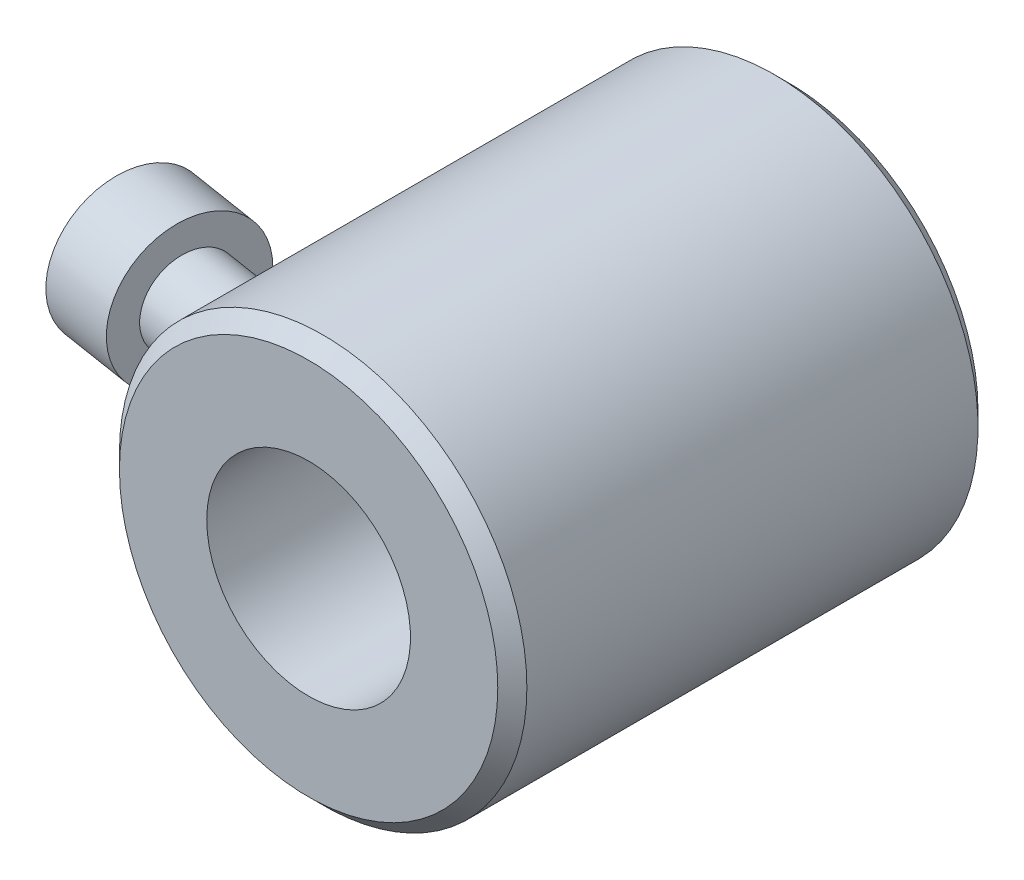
ISO-10303-21;
HEADER;
FILE_DESCRIPTION(('STEP AP214'),'2;1');
FILE_NAME('part.step','',(''),(''),'','','');
FILE_SCHEMA(('AUTOMOTIVE_DESIGN { 1 0 10303 214 1 1 1 1 }'));
ENDSEC;
DATA;
#1=APPLICATION_CONTEXT('core data for automotive mechanical design processes');
#2=APPLICATION_PROTOCOL_DEFINITION('international standard','automotive_design',2000,#1);
#3=PRODUCT_CONTEXT('',#1,'mechanical');
#4=PRODUCT('Part','Part','',(#3));
#5=PRODUCT_RELATED_PRODUCT_CATEGORY('part','',(#4));
#6=PRODUCT_DEFINITION_FORMATION('','',#4);
#7=PRODUCT_DEFINITION_CONTEXT('part definition',#1,'design');
#8=PRODUCT_DEFINITION('design','',#6,#7);
#9=PRODUCT_DEFINITION_SHAPE('','',#8);
#10=(LENGTH_UNIT() NAMED_UNIT(*) SI_UNIT(.MILLI.,.METRE.));
#11=(NAMED_UNIT(*) PLANE_ANGLE_UNIT() SI_UNIT($,.RADIAN.));
#12=(NAMED_UNIT(*) SI_UNIT($,.STERADIAN.) SOLID_ANGLE_UNIT());
#13=UNCERTAINTY_MEASURE_WITH_UNIT(LENGTH_MEASURE(1.E-05),#10,'distance_accuracy_value','');
#14=(GEOMETRIC_REPRESENTATION_CONTEXT(3) GLOBAL_UNCERTAINTY_ASSIGNED_CONTEXT((#13)) GLOBAL_UNIT_ASSIGNED_CONTEXT((#10,
#11,#12)) REPRESENTATION_CONTEXT('',''));
#15=CARTESIAN_POINT('',(0.,0.,0.));
#16=DIRECTION('',(0.,0.,1.));
#17=DIRECTION('',(1.,0.,0.));
#18=AXIS2_PLACEMENT_3D('',#15,#16,#17);
#19=CARTESIAN_POINT('',(0.,0.,110.));
#20=DIRECTION('',(0.,0.,1.));
#21=DIRECTION('',(-1.,0.,0.));
#22=AXIS2_PLACEMENT_3D('',#19,#20,#21);
#23=CYLINDRICAL_SURFACE('',#22,14.);
#24=CARTESIAN_POINT('',(-14.,0.,18.6127242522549));
#25=CARTESIAN_POINT('',(-13.999996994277,-0.161729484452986,18.6127311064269));
#26=CARTESIAN_POINT('',(-13.9971679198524,-0.323531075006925,18.626468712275));
#27=CARTESIAN_POINT('',(-13.9861651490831,-0.642424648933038,18.6808615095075));
#28=CARTESIAN_POINT('',(-13.9779872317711,-0.799512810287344,18.7215379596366));
#29=CARTESIAN_POINT('',(-13.9572213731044,-1.10419941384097,18.8280562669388));
#30=CARTESIAN_POINT('',(-13.9446426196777,-1.25181687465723,18.8938457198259));
#31=CARTESIAN_POINT('',(-13.9164044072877,-1.53423024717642,19.0482242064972));
#32=CARTESIAN_POINT('',(-13.9007447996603,-1.66902553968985,19.1368143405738));
#33=CARTESIAN_POINT('',(-13.8673501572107,-1.92721186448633,19.3374645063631));
#34=CARTESIAN_POINT('',(-13.8495620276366,-2.05004626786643,19.4502311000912));
#35=CARTESIAN_POINT('',(-13.8142115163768,-2.27611060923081,19.6939909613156));
#36=CARTESIAN_POINT('',(-13.7966491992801,-2.3793350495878,19.8249893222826));
#37=CARTESIAN_POINT('',(-13.7626951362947,-2.56865097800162,20.1089946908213));
#38=CARTESIAN_POINT('',(-13.7464104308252,-2.65358469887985,20.2627882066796));
#39=CARTESIAN_POINT('',(-13.7179645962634,-2.79692944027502,20.5826534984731));
#40=CARTESIAN_POINT('',(-13.7058037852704,-2.85533841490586,20.7487262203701));
#41=CARTESIAN_POINT('',(-13.6870431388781,-2.94396652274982,21.0896434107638));
#42=CARTESIAN_POINT('',(-13.6804772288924,-2.974013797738,21.2645346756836));
#43=CARTESIAN_POINT('',(-13.6739510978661,-3.00388307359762,21.6170016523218));
#44=CARTESIAN_POINT('',(-13.6739892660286,-3.00371244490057,21.7945766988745));
#45=CARTESIAN_POINT('',(-13.6806644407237,-2.97315312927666,22.1408530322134));
#46=CARTESIAN_POINT('',(-13.6870755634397,-2.94379882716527,22.3096500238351));
#47=CARTESIAN_POINT('',(-13.7054760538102,-2.8569007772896,22.6395013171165));
#48=CARTESIAN_POINT('',(-13.7174646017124,-2.7993611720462,22.8005567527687));
#49=CARTESIAN_POINT('',(-13.7452446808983,-2.65954024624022,23.1058833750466));
#50=CARTESIAN_POINT('',(-13.7609250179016,-2.577967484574,23.2504899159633));
#51=CARTESIAN_POINT('',(-13.7944928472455,-2.39183596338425,23.5237722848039));
#52=CARTESIAN_POINT('',(-13.8123803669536,-2.28727691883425,23.652447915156));
#53=CARTESIAN_POINT('',(-13.8484147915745,-2.05788258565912,23.8906741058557));
#54=CARTESIAN_POINT('',(-13.8665621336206,-1.93300822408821,24.0001869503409));
#55=CARTESIAN_POINT('',(-13.9010950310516,-1.66660503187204,24.1969780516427));
#56=CARTESIAN_POINT('',(-13.9174804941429,-1.52507532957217,24.2842551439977));
#57=CARTESIAN_POINT('',(-13.9468775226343,-1.22766045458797,24.435193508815));
#58=CARTESIAN_POINT('',(-13.959850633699,-1.07163643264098,24.4985888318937));
#59=CARTESIAN_POINT('',(-13.9807679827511,-0.750952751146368,24.5987943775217));
#60=CARTESIAN_POINT('',(-13.9887121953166,-0.586293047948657,24.6356044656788));
#61=CARTESIAN_POINT('',(-13.9987169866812,-0.252639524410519,24.6817417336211));
#62=CARTESIAN_POINT('',(-14.0007652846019,-0.0836373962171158,24.6910115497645));
#63=CARTESIAN_POINT('',(-13.998719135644,0.253555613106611,24.6816636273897));
#64=CARTESIAN_POINT('',(-13.9946246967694,0.421746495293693,24.6630459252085));
#65=CARTESIAN_POINT('',(-13.9807506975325,0.752294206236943,24.5984531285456));
#66=CARTESIAN_POINT('',(-13.9709792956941,0.914659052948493,24.5525172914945));
#67=CARTESIAN_POINT('',(-13.9468240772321,1.22922873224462,24.4344984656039));
#68=CARTESIAN_POINT('',(-13.9324401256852,1.38143326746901,24.3624147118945));
#69=CARTESIAN_POINT('',(-13.900611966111,1.67163263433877,24.1938021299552));
#70=CARTESIAN_POINT('',(-13.8831627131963,1.80960343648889,24.0972328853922));
#71=CARTESIAN_POINT('',(-13.8471633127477,2.06712437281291,23.8822098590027));
#72=CARTESIAN_POINT('',(-13.8286131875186,2.18667488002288,23.7637565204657));
#73=CARTESIAN_POINT('',(-13.7925661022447,2.40358159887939,23.5085227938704));
#74=CARTESIAN_POINT('',(-13.7750660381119,2.5010058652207,23.3718007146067));
#75=CARTESIAN_POINT('',(-13.7430540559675,2.67133079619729,23.0835428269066));
#76=CARTESIAN_POINT('',(-13.7285418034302,2.74423420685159,22.932008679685));
#77=CARTESIAN_POINT('',(-13.7042977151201,2.86284309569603,22.6202568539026));
#78=CARTESIAN_POINT('',(-13.6945139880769,2.90884502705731,22.4601559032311));
#79=CARTESIAN_POINT('',(-13.6805426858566,2.97386456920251,22.134343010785));
#80=CARTESIAN_POINT('',(-13.6763550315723,2.99288256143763,21.9686311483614));
#81=CARTESIAN_POINT('',(-13.6739589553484,3.00381026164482,21.636177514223));
#82=CARTESIAN_POINT('',(-13.6757548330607,2.99570047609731,21.469435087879));
#83=CARTESIAN_POINT('',(-13.6850326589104,2.95302273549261,21.1395419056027));
#84=CARTESIAN_POINT('',(-13.6925155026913,2.91845061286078,20.9763917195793));
#85=CARTESIAN_POINT('',(-13.7125637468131,2.8227716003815,20.6532480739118));
#86=CARTESIAN_POINT('',(-13.7252697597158,2.76092685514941,20.4934820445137));
#87=CARTESIAN_POINT('',(-13.7543041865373,2.61243482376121,20.1862659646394));
#88=CARTESIAN_POINT('',(-13.7706334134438,2.52578196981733,20.0388186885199));
#89=CARTESIAN_POINT('',(-13.8057121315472,2.32655519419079,19.7553860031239));
#90=CARTESIAN_POINT('',(-13.8245242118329,2.21321265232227,19.6199474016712));
#91=CARTESIAN_POINT('',(-13.8619670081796,1.96508890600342,19.3702531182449));
#92=CARTESIAN_POINT('',(-13.880597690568,1.83030379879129,19.2560013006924));
#93=CARTESIAN_POINT('',(-13.9153691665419,1.54374834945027,19.0532802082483));
#94=CARTESIAN_POINT('',(-13.9315272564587,1.39211014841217,18.9646275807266));
#95=CARTESIAN_POINT('',(-13.9595447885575,1.07529751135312,18.8155129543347));
#96=CARTESIAN_POINT('',(-13.9714097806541,0.910140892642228,18.7550145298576));
#97=CARTESIAN_POINT('',(-13.9867785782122,0.620226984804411,18.6777629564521));
#98=CARTESIAN_POINT('',(-13.9917057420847,0.497514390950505,18.6534322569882));
#99=CARTESIAN_POINT('',(-13.9983174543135,0.249882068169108,18.6209110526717));
#100=CARTESIAN_POINT('',(-14.0000023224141,0.124962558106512,18.6127189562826));
#101=CARTESIAN_POINT('',(-14.,0.,18.6127242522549));
#102=B_SPLINE_CURVE_WITH_KNOTS('',3,(#24,#25,#26,#27,#28,#29,#30,#31,#32,#33,#34,#35,#36,#37,
#38,#39,#40,#41,#42,#43,#44,#45,#46,#47,#48,#49,#50,#51,#52,#53,#54,#55,#56,#57,#58,#59,#60,#61,
#62,#63,#64,#65,#66,#67,#68,#69,#70,#71,#72,#73,#74,#75,#76,#77,#78,#79,#80,#81,#82,#83,#84,#85,
#86,#87,#88,#89,#90,#91,#92,#93,#94,#95,#96,#97,#98,#99,#100,#101),.UNSPECIFIED.,.T.,.F.,(4,2,2,
2,2,2,2,2,2,2,2,2,2,2,2,2,2,2,2,2,2,2,2,2,2,2,2,2,2,2,2,2,2,2,2,2,2,2,4),(0.,0.484717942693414,
0.96981885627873,1.45391297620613,1.93803046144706,2.43891405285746,2.93993785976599,
3.46679403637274,3.99369084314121,4.52376027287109,5.05370041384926,5.56550384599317,
6.07723207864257,6.57516963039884,7.07311335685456,7.57202636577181,8.07096549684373,
8.57530722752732,9.07965150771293,9.58504555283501,10.0904389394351,10.5951078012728,
11.0997914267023,11.6053135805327,12.1108254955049,12.6147608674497,13.1186397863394,
13.6168559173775,14.115065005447,14.6136321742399,15.112277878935,15.6253319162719,
16.1385011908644,16.6687981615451,17.1991917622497,17.7256864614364,18.2514980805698,
18.6260591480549,19.000583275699),.UNSPECIFIED.);
#103=CARTESIAN_POINT('',(-14.,0.,18.6127242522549));
#104=VERTEX_POINT('',#103);
#105=EDGE_CURVE('E9',#104,#104,#102,.T.);
#106=ORIENTED_EDGE('',*,*,#105,.F.);
#107=EDGE_LOOP('',(#106));
#108=FACE_BOUND('',#107,.T.);
#109=CARTESIAN_POINT('',(0.,0.,32.));
#110=DIRECTION('',(0.,0.,-1.));
#111=DIRECTION('',(1.,0.,0.));
#112=AXIS2_PLACEMENT_3D('',#109,#110,#111);
#113=CIRCLE('',#112,14.);
#114=CARTESIAN_POINT('',(14.,0.,32.));
#115=VERTEX_POINT('',#114);
#116=EDGE_CURVE('E199',#115,#115,#113,.T.);
#117=ORIENTED_EDGE('',*,*,#116,.T.);
#118=EDGE_LOOP('',(#117));
#119=FACE_BOUND('',#118,.T.);
#120=CARTESIAN_POINT('',(0.,0.,1.00000000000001));
#121=DIRECTION('',(0.,0.,1.));
#122=DIRECTION('',(-1.,0.,0.));
#123=AXIS2_PLACEMENT_3D('',#120,#121,#122);
#124=CIRCLE('',#123,14.);
#125=CARTESIAN_POINT('',(-14.,0.,1.00000000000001));
#126=VERTEX_POINT('',#125);
#127=EDGE_CURVE('E203',#126,#126,#124,.T.);
#128=ORIENTED_EDGE('',*,*,#127,.T.);
#129=EDGE_LOOP('',(#128));
#130=FACE_BOUND('',#129,.T.);
#131=CARTESIAN_POINT('',(-1.25,-13.9440847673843,10.));
#132=CARTESIAN_POINT('',(-1.24999694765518,-13.9440855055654,10.0700627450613));
#133=CARTESIAN_POINT('',(-1.24408962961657,-13.944618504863,10.140172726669));
#134=CARTESIAN_POINT('',(-1.22061192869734,-13.9466927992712,10.2784515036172));
#135=CARTESIAN_POINT('',(-1.20302845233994,-13.9482352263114,10.3466180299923));
#136=CARTESIAN_POINT('',(-1.15671220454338,-13.9521522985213,10.4789872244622));
#137=CARTESIAN_POINT('',(-1.12798590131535,-13.9545264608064,10.5431921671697));
#138=CARTESIAN_POINT('',(-1.06021125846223,-13.9598388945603,10.6658542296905));
#139=CARTESIAN_POINT('',(-1.02116507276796,-13.9627770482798,10.7243125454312));
#140=CARTESIAN_POINT('',(-0.933735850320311,-13.9688960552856,10.834007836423));
#141=CARTESIAN_POINT('',(-0.885328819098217,-13.9720775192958,10.8852256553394));
#142=CARTESIAN_POINT('',(-0.780602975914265,-13.9783191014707,10.9788213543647));
#143=CARTESIAN_POINT('',(-0.724283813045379,-13.9813792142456,11.0211988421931));
#144=CARTESIAN_POINT('',(-0.605216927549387,-13.9870391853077,11.0959756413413));
#145=CARTESIAN_POINT('',(-0.542458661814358,-13.9896382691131,11.128358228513));
#146=CARTESIAN_POINT('',(-0.412368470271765,-13.9940767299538,11.1821190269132));
#147=CARTESIAN_POINT('',(-0.345036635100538,-13.995916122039,11.2034974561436));
#148=CARTESIAN_POINT('',(-0.207902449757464,-13.9986236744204,11.2345875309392));
#149=CARTESIAN_POINT('',(-0.138107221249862,-13.9994944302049,11.2443303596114));
#150=CARTESIAN_POINT('',(0.00213288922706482,-14.0001754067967,11.2519690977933));
#151=CARTESIAN_POINT('',(0.0725777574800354,-13.9999856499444,11.249865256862));
#152=CARTESIAN_POINT('',(0.211905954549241,-13.9985691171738,11.2338958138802));
#153=CARTESIAN_POINT('',(0.280793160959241,-13.9973452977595,11.220063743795));
#154=CARTESIAN_POINT('',(0.415264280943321,-13.9940016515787,11.181082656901));
#155=CARTESIAN_POINT('',(0.480848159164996,-13.9918818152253,11.1559335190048));
#156=CARTESIAN_POINT('',(0.606957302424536,-13.9869794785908,11.0949950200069));
#157=CARTESIAN_POINT('',(0.667475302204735,-13.9841960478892,11.0591907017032));
#158=CARTESIAN_POINT('',(0.78165551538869,-13.9782791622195,10.977969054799));
#159=CARTESIAN_POINT('',(0.835317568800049,-13.9751456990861,10.9325515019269));
#160=CARTESIAN_POINT('',(0.934458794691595,-13.968867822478,10.8332037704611));
#161=CARTESIAN_POINT('',(0.979908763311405,-13.9657234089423,10.7792444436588));
#162=CARTESIAN_POINT('',(1.06110988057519,-13.9597889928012,10.6644462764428));
#163=CARTESIAN_POINT('',(1.09686101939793,-13.9569989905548,10.6036074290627));
#164=CARTESIAN_POINT('',(1.1576488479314,-13.9520888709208,10.4767560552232));
#165=CARTESIAN_POINT('',(1.18268392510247,-13.9499688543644,10.4107427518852));
#166=CARTESIAN_POINT('',(1.22130685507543,-13.9466407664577,10.2754265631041));
#167=CARTESIAN_POINT('',(1.23489498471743,-13.9454326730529,10.2061237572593));
#168=CARTESIAN_POINT('',(1.25020113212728,-13.9440688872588,10.0664516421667));
#169=CARTESIAN_POINT('',(1.25195991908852,-13.9439095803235,9.99608683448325));
#170=CARTESIAN_POINT('',(1.2436643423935,-13.9446518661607,9.85606342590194));
#171=CARTESIAN_POINT('',(1.23361010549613,-13.9455534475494,9.78640481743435));
#172=CARTESIAN_POINT('',(1.20200791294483,-13.9483126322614,9.64988880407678));
#173=CARTESIAN_POINT('',(1.1804790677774,-13.9501686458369,9.58302694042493));
#174=CARTESIAN_POINT('',(1.12655823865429,-13.9546262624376,9.45386410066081));
#175=CARTESIAN_POINT('',(1.09416605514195,-13.9572278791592,9.39156320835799));
#176=CARTESIAN_POINT('',(1.01933522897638,-13.9628923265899,9.27310448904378));
#177=CARTESIAN_POINT('',(0.976869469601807,-13.9659563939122,9.21696385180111));
#178=CARTESIAN_POINT('',(0.883136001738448,-13.9721963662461,9.11259319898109));
#179=CARTESIAN_POINT('',(0.831868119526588,-13.975372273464,9.06436333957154));
#180=CARTESIAN_POINT('',(0.721809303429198,-13.9814888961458,8.97704366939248));
#181=CARTESIAN_POINT('',(0.662997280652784,-13.9844289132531,8.93798038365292));
#182=CARTESIAN_POINT('',(0.539624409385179,-13.9897323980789,8.87028489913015));
#183=CARTESIAN_POINT('',(0.475063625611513,-13.9920958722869,8.84165258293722));
#184=CARTESIAN_POINT('',(0.342120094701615,-13.9959767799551,8.79567715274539));
#185=CARTESIAN_POINT('',(0.273743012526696,-13.9974954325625,8.77831776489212));
#186=CARTESIAN_POINT('',(0.135030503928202,-13.9995205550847,8.75532779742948));
#187=CARTESIAN_POINT('',(0.0646951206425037,-14.0000270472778,8.7496969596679));
#188=CARTESIAN_POINT('',(-0.0756762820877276,-13.999970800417,8.75032714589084));
#189=CARTESIAN_POINT('',(-0.145712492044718,-13.99941177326,8.75654688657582));
#190=CARTESIAN_POINT('',(-0.283741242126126,-13.997294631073,8.78061542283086));
#191=CARTESIAN_POINT('',(-0.351733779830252,-13.9957365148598,8.79846423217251));
#192=CARTESIAN_POINT('',(-0.483746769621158,-13.9917959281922,8.84527342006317));
#193=CARTESIAN_POINT('',(-0.547767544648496,-13.9894135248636,8.87423289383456));
#194=CARTESIAN_POINT('',(-0.670045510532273,-13.9840905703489,8.94243676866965));
#195=CARTESIAN_POINT('',(-0.728302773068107,-13.9811500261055,8.98168104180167));
#196=CARTESIAN_POINT('',(-0.837611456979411,-13.9750284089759,9.0694955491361));
#197=CARTESIAN_POINT('',(-0.88863822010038,-13.9718465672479,9.11809642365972));
#198=CARTESIAN_POINT('',(-0.981832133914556,-13.9656075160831,9.22318700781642));
#199=CARTESIAN_POINT('',(-1.02399714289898,-13.9625503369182,9.27967861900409));
#200=CARTESIAN_POINT('',(-1.09833680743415,-13.9568998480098,9.39907248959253));
#201=CARTESIAN_POINT('',(-1.13049034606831,-13.9543075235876,9.46198793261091));
#202=CARTESIAN_POINT('',(-1.18373517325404,-13.9498921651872,9.59230584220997));
#203=CARTESIAN_POINT('',(-1.20483909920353,-13.9480682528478,9.65970308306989));
#204=CARTESIAN_POINT('',(-1.23004834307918,-13.9458622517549,9.77291056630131));
#205=CARTESIAN_POINT('',(-1.2375201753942,-13.9451987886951,9.81799411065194));
#206=CARTESIAN_POINT('',(-1.24749699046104,-13.9443098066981,9.90871175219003));
#207=CARTESIAN_POINT('',(-1.25000198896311,-13.9440842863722,9.95434584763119));
#208=CARTESIAN_POINT('',(-1.25,-13.9440847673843,10.));
#209=B_SPLINE_CURVE_WITH_KNOTS('',3,(#131,#132,#133,#134,#135,#136,#137,#138,#139,#140,#141,
#142,#143,#144,#145,#146,#147,#148,#149,#150,#151,#152,#153,#154,#155,#156,#157,#158,#159,#160,
#161,#162,#163,#164,#165,#166,#167,#168,#169,#170,#171,#172,#173,#174,#175,#176,#177,#178,#179,
#180,#181,#182,#183,#184,#185,#186,#187,#188,#189,#190,#191,#192,#193,#194,#195,#196,#197,#198,
#199,#200,#201,#202,#203,#204,#205,#206,#207,#208),.UNSPECIFIED.,.T.,.F.,(4,2,2,2,2,2,2,2,2,2,2,
2,2,2,2,2,2,2,2,2,2,2,2,2,2,2,2,2,2,2,2,2,2,2,2,2,2,2,4),(0.,0.210021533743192,
0.420278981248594,0.630414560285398,0.840506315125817,1.05114390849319,1.26179084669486,
1.47278836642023,1.68378170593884,1.89420831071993,2.10463048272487,2.314453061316,
2.52427788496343,2.73439865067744,2.94452431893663,3.15538312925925,3.36624215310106,
3.57713289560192,3.78801853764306,3.99817699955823,4.2083332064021,4.4181404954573,
4.62795163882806,4.83833410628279,5.04872072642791,5.25970882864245,5.47069455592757,
5.68137501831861,5.89205084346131,6.10199408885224,6.31193758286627,6.52186398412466,
6.73178777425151,6.94241107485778,7.15308522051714,7.36420077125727,7.57507433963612,
7.71192860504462,7.84878243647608),.UNSPECIFIED.);
#210=CARTESIAN_POINT('',(-1.25,-13.9440847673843,10.));
#211=VERTEX_POINT('',#210);
#212=EDGE_CURVE('E137',#211,#211,#209,.T.);
#213=ORIENTED_EDGE('',*,*,#212,.T.);
#214=EDGE_LOOP('',(#213));
#215=FACE_BOUND('',#214,.T.);
#216=ADVANCED_FACE('F14',(#108,#119,#130,#215),#23,.T.);
#217=CARTESIAN_POINT('',(0.,0.,110.));
#218=DIRECTION('',(0.,0.,1.));
#219=DIRECTION('',(-1.,0.,0.));
#220=AXIS2_PLACEMENT_3D('',#217,#218,#219);
#221=CYLINDRICAL_SURFACE('',#220,7.);
#222=CARTESIAN_POINT('',(0.,0.,33.));
#223=DIRECTION('',(0.,0.,1.));
#224=DIRECTION('',(-1.,0.,0.));
#225=AXIS2_PLACEMENT_3D('',#222,#223,#224);
#226=CIRCLE('',#225,7.);
#227=CARTESIAN_POINT('',(-7.,0.,33.));
#228=VERTEX_POINT('',#227);
#229=EDGE_CURVE('E144',#228,#228,#226,.T.);
#230=ORIENTED_EDGE('',*,*,#229,.T.);
#231=EDGE_LOOP('',(#230));
#232=FACE_BOUND('',#231,.T.);
#233=CARTESIAN_POINT('',(0.,0.,6.));
#234=DIRECTION('',(0.,0.,1.));
#235=DIRECTION('',(-1.,0.,0.));
#236=AXIS2_PLACEMENT_3D('',#233,#234,#235);
#237=CIRCLE('',#236,7.);
#238=CARTESIAN_POINT('',(-7.,0.,6.));
#239=VERTEX_POINT('',#238);
#240=EDGE_CURVE('E372',#239,#239,#237,.T.);
#241=ORIENTED_EDGE('',*,*,#240,.F.);
#242=EDGE_LOOP('',(#241));
#243=FACE_BOUND('',#242,.T.);
#244=CARTESIAN_POINT('',(-1.25,-6.88748865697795,10.));
#245=CARTESIAN_POINT('',(-1.24999727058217,-6.88748996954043,10.0696098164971));
#246=CARTESIAN_POINT('',(-1.24416565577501,-6.88855539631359,10.1392557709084));
#247=CARTESIAN_POINT('',(-1.22100652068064,-6.89269731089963,10.2765881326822));
#248=CARTESIAN_POINT('',(-1.20366887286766,-6.89577557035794,10.3442727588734));
#249=CARTESIAN_POINT('',(-1.15804345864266,-6.90358364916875,10.4756753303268));
#250=CARTESIAN_POINT('',(-1.12976542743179,-6.90831199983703,10.5393967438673));
#251=CARTESIAN_POINT('',(-1.06308709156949,-6.91888575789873,10.6611855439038));
#252=CARTESIAN_POINT('',(-1.024687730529,-6.92473106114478,10.7192534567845));
#253=CARTESIAN_POINT('',(-0.938394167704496,-6.93695388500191,10.8287484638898));
#254=CARTESIAN_POINT('',(-0.890407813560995,-6.94333619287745,10.8801024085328));
#255=CARTESIAN_POINT('',(-0.786501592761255,-6.95587151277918,10.9740752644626));
#256=CARTESIAN_POINT('',(-0.730581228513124,-6.96202451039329,11.0166936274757));
#257=CARTESIAN_POINT('',(-0.611916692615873,-6.97345895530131,11.0922633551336));
#258=CARTESIAN_POINT('',(-0.549128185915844,-6.97873410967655,11.1251461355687));
#259=CARTESIAN_POINT('',(-0.418808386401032,-6.98776505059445,11.1798698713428));
#260=CARTESIAN_POINT('',(-0.351277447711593,-6.99152095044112,11.2017116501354));
#261=CARTESIAN_POINT('',(-0.21414683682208,-6.99705638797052,11.2335082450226));
#262=CARTESIAN_POINT('',(-0.144576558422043,-6.99885638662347,11.2435862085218));
#263=CARTESIAN_POINT('',(-0.00471086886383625,-7.00034763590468,11.2519524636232));
#264=CARTESIAN_POINT('',(0.0655844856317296,-7.00003905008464,11.2502416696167));
#265=CARTESIAN_POINT('',(0.204061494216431,-6.9973639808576,11.2351741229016));
#266=CARTESIAN_POINT('',(0.272258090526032,-6.99502092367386,11.2219499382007));
#267=CARTESIAN_POINT('',(0.405448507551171,-6.98856637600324,11.1844402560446));
#268=CARTESIAN_POINT('',(0.470442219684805,-6.98445482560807,11.1601543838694));
#269=CARTESIAN_POINT('',(0.595770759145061,-6.97488577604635,11.1010820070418));
#270=CARTESIAN_POINT('',(0.656079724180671,-6.96942141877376,11.0662417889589));
#271=CARTESIAN_POINT('',(0.770045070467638,-6.95775231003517,10.9870891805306));
#272=CARTESIAN_POINT('',(0.823700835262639,-6.95154749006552,10.9427759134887));
#273=CARTESIAN_POINT('',(0.923621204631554,-6.93898404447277,10.8452024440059));
#274=CARTESIAN_POINT('',(0.969772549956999,-6.93262448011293,10.7918263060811));
#275=CARTESIAN_POINT('',(1.05248393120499,-6.92055128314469,10.6780303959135));
#276=CARTESIAN_POINT('',(1.08904385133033,-6.9148376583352,10.6176105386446));
#277=CARTESIAN_POINT('',(1.15156239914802,-6.90470226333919,10.4913004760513));
#278=CARTESIAN_POINT('',(1.17750582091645,-6.90028234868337,10.4254025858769));
#279=CARTESIAN_POINT('',(1.21792201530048,-6.89326416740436,10.2900870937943));
#280=CARTESIAN_POINT('',(1.23239595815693,-6.89066571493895,10.2206698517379));
#281=CARTESIAN_POINT('',(1.24929958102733,-6.88762108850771,10.0813039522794));
#282=CARTESIAN_POINT('',(1.25189141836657,-6.88714593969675,10.011375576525));
#283=CARTESIAN_POINT('',(1.24539080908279,-6.88832434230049,9.87208483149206));
#284=CARTESIAN_POINT('',(1.23629888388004,-6.88997779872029,9.802722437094));
#285=CARTESIAN_POINT('',(1.20682762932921,-6.89520021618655,9.66705770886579));
#286=CARTESIAN_POINT('',(1.18653221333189,-6.89875493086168,9.60073654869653));
#287=CARTESIAN_POINT('',(1.13531866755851,-6.90736720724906,9.47243634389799));
#288=CARTESIAN_POINT('',(1.10439981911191,-6.912424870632,9.41045759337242));
#289=CARTESIAN_POINT('',(1.03243967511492,-6.9235397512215,9.29188393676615));
#290=CARTESIAN_POINT('',(0.991295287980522,-6.92960692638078,9.23535254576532));
#291=CARTESIAN_POINT('',(0.900192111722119,-6.94202871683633,9.12993787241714));
#292=CARTESIAN_POINT('',(0.85023260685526,-6.948383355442,9.08105521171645));
#293=CARTESIAN_POINT('',(0.742195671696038,-6.96075653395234,8.99172584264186));
#294=CARTESIAN_POINT('',(0.684027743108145,-6.96677010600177,8.95138779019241));
#295=CARTESIAN_POINT('',(0.56164648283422,-6.97770176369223,8.88105696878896));
#296=CARTESIAN_POINT('',(0.497433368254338,-6.98261988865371,8.8510638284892));
#297=CARTESIAN_POINT('',(0.365094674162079,-6.99078504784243,8.8024397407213));
#298=CARTESIAN_POINT('',(0.296989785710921,-6.99404014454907,8.78375389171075));
#299=CARTESIAN_POINT('',(0.158545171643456,-6.99854674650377,8.75809885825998));
#300=CARTESIAN_POINT('',(0.0882056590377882,-6.9997984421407,8.75112856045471));
#301=CARTESIAN_POINT('',(-0.0516665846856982,-7.00015390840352,8.74913828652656));
#302=CARTESIAN_POINT('',(-0.121196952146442,-6.99928727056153,8.75395367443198));
#303=CARTESIAN_POINT('',(-0.258441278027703,-6.99556445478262,8.77503948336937));
#304=CARTESIAN_POINT('',(-0.326155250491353,-6.99270829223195,8.79130981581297));
#305=CARTESIAN_POINT('',(-0.457768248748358,-6.98532676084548,8.83477696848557));
#306=CARTESIAN_POINT('',(-0.521672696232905,-6.98080383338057,8.86195781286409));
#307=CARTESIAN_POINT('',(-0.644038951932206,-6.97058019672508,8.92645534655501));
#308=CARTESIAN_POINT('',(-0.702500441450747,-6.96487941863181,8.96377262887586));
#309=CARTESIAN_POINT('',(-0.813145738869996,-6.95283653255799,9.04805799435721));
#310=CARTESIAN_POINT('',(-0.865237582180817,-6.94648702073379,9.09514575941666));
#311=CARTESIAN_POINT('',(-0.960837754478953,-6.9339109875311,9.19738568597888));
#312=CARTESIAN_POINT('',(-1.0043440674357,-6.92768449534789,9.25253973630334));
#313=CARTESIAN_POINT('',(-1.08187311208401,-6.91600352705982,9.36989058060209));
#314=CARTESIAN_POINT('',(-1.1158144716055,-6.9105558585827,9.43214182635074));
#315=CARTESIAN_POINT('',(-1.17270443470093,-6.90113054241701,9.56153753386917));
#316=CARTESIAN_POINT('',(-1.19566368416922,-6.89715147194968,9.62867718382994));
#317=CARTESIAN_POINT('',(-1.22512899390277,-6.89196709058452,9.74670336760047));
#318=CARTESIAN_POINT('',(-1.23444009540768,-6.89029736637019,9.7968879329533));
#319=CARTESIAN_POINT('',(-1.24687652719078,-6.88805768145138,9.89804188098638));
#320=CARTESIAN_POINT('',(-1.25000199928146,-6.88748769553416,9.94901124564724));
#321=CARTESIAN_POINT('',(-1.25,-6.88748865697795,10.));
#322=B_SPLINE_CURVE_WITH_KNOTS('',3,(#244,#245,#246,#247,#248,#249,#250,#251,#252,#253,#254,
#255,#256,#257,#258,#259,#260,#261,#262,#263,#264,#265,#266,#267,#268,#269,#270,#271,#272,#273,
#274,#275,#276,#277,#278,#279,#280,#281,#282,#283,#284,#285,#286,#287,#288,#289,#290,#291,#292,
#293,#294,#295,#296,#297,#298,#299,#300,#301,#302,#303,#304,#305,#306,#307,#308,#309,#310,#311,
#312,#313,#314,#315,#316,#317,#318,#319,#320,#321),.UNSPECIFIED.,.T.,.F.,(4,2,2,2,2,2,2,2,2,2,2,
2,2,2,2,2,2,2,2,2,2,2,2,2,2,2,2,2,2,2,2,2,2,2,2,2,2,2,4),(0.,0.208642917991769,0.41746972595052,
0.626111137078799,0.834733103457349,1.04546625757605,1.25621263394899,1.46841013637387,
1.68059181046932,1.89053179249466,2.10045549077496,2.30799357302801,2.51553868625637,
2.72415831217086,2.93279725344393,3.14433992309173,3.35588514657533,3.56773231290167,
3.77955786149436,3.98848380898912,4.19740043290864,4.40477310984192,4.61215981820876,
4.82172878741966,5.03131478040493,5.24342420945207,5.45552602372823,5.66658955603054,
5.87763302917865,6.08574527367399,6.29385590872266,6.50166292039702,6.70948209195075,
6.9200155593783,7.1305984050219,7.34292209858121,7.55503954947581,7.70787268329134,
7.86070231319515),.UNSPECIFIED.);
#323=CARTESIAN_POINT('',(-1.25,-6.88748865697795,10.));
#324=VERTEX_POINT('',#323);
#325=EDGE_CURVE('E136',#324,#324,#322,.T.);
#326=ORIENTED_EDGE('',*,*,#325,.F.);
#327=EDGE_LOOP('',(#326));
#328=FACE_BOUND('',#327,.T.);
#329=ADVANCED_FACE('F168',(#232,#243,#328),#221,.F.);
#330=CARTESIAN_POINT('',(0.,-3.3,0.));
#331=DIRECTION('',(0.,0.,1.));
#332=DIRECTION('',(-1.,0.,0.));
#333=AXIS2_PLACEMENT_3D('',#330,#331,#332);
#334=PLANE('',#333);
#335=CARTESIAN_POINT('',(0.,0.,0.));
#336=DIRECTION('',(0.,0.,1.));
#337=DIRECTION('',(-1.,0.,0.));
#338=AXIS2_PLACEMENT_3D('',#335,#336,#337);
#339=CIRCLE('',#338,13.);
#340=CARTESIAN_POINT('',(-13.,0.,0.));
#341=VERTEX_POINT('',#340);
#342=EDGE_CURVE('E26',#341,#341,#339,.F.);
#343=ORIENTED_EDGE('',*,*,#342,.T.);
#344=EDGE_LOOP('',(#343));
#345=FACE_BOUND('',#344,.T.);
#346=CARTESIAN_POINT('',(0.,0.,0.));
#347=DIRECTION('',(0.,0.,1.));
#348=DIRECTION('',(-1.,0.,0.));
#349=AXIS2_PLACEMENT_3D('',#346,#347,#348);
#350=CIRCLE('',#349,3.3);
#351=CARTESIAN_POINT('',(-3.3,0.,0.));
#352=VERTEX_POINT('',#351);
#353=EDGE_CURVE('E164',#352,#352,#350,.T.);
#354=ORIENTED_EDGE('',*,*,#353,.T.);
#355=EDGE_LOOP('',(#354));
#356=FACE_BOUND('',#355,.T.);
#357=ADVANCED_FACE('F172',(#345,#356),#334,.F.);
#358=CARTESIAN_POINT('',(0.,0.,110.));
#359=DIRECTION('',(0.,0.,1.));
#360=DIRECTION('',(-1.,0.,0.));
#361=AXIS2_PLACEMENT_3D('',#358,#359,#360);
#362=CYLINDRICAL_SURFACE('',#361,3.3);
#363=ORIENTED_EDGE('',*,*,#353,.F.);
#364=EDGE_LOOP('',(#363));
#365=FACE_BOUND('',#364,.T.);
#366=CARTESIAN_POINT('',(0.,0.,6.));
#367=DIRECTION('',(0.,0.,1.));
#368=DIRECTION('',(-1.,0.,0.));
#369=AXIS2_PLACEMENT_3D('',#366,#367,#368);
#370=CIRCLE('',#369,3.3);
#371=CARTESIAN_POINT('',(-3.3,0.,6.));
#372=VERTEX_POINT('',#371);
#373=EDGE_CURVE('E374',#372,#372,#370,.T.);
#374=ORIENTED_EDGE('',*,*,#373,.T.);
#375=EDGE_LOOP('',(#374));
#376=FACE_BOUND('',#375,.T.);
#377=ADVANCED_FACE('F177',(#365,#376),#362,.F.);
#378=CARTESIAN_POINT('',(0.,-7.,6.));
#379=DIRECTION('',(0.,0.,-1.));
#380=DIRECTION('',(1.,0.,0.));
#381=AXIS2_PLACEMENT_3D('',#378,#379,#380);
#382=PLANE('',#381);
#383=ORIENTED_EDGE('',*,*,#373,.F.);
#384=EDGE_LOOP('',(#383));
#385=FACE_BOUND('',#384,.T.);
#386=ORIENTED_EDGE('',*,*,#240,.T.);
#387=EDGE_LOOP('',(#386));
#388=FACE_BOUND('',#387,.T.);
#389=ADVANCED_FACE('F174',(#385,#388),#382,.F.);
#390=CARTESIAN_POINT('',(0.,-14.,33.));
#391=DIRECTION('',(0.,0.,-1.));
#392=DIRECTION('',(1.,0.,0.));
#393=AXIS2_PLACEMENT_3D('',#390,#391,#392);
#394=PLANE('',#393);
#395=CARTESIAN_POINT('',(0.,0.,33.));
#396=DIRECTION('',(0.,0.,-1.));
#397=DIRECTION('',(1.,0.,0.));
#398=AXIS2_PLACEMENT_3D('',#395,#396,#397);
#399=CIRCLE('',#398,13.);
#400=CARTESIAN_POINT('',(13.,0.,33.));
#401=VERTEX_POINT('',#400);
#402=EDGE_CURVE('E166',#401,#401,#399,.F.);
#403=ORIENTED_EDGE('',*,*,#402,.T.);
#404=EDGE_LOOP('',(#403));
#405=FACE_BOUND('',#404,.T.);
#406=ORIENTED_EDGE('',*,*,#229,.F.);
#407=EDGE_LOOP('',(#406));
#408=FACE_BOUND('',#407,.T.);
#409=ADVANCED_FACE('F152',(#405,#408),#394,.F.);
#410=CARTESIAN_POINT('',(0.,17.,10.));
#411=DIRECTION('',(0.,1.,0.));
#412=DIRECTION('',(-1.,0.,0.));
#413=AXIS2_PLACEMENT_3D('',#410,#411,#412);
#414=CYLINDRICAL_SURFACE('',#413,1.25);
#415=ORIENTED_EDGE('',*,*,#212,.F.);
#416=EDGE_LOOP('',(#415));
#417=FACE_BOUND('',#416,.T.);
#418=ORIENTED_EDGE('',*,*,#325,.T.);
#419=EDGE_LOOP('',(#418));
#420=FACE_BOUND('',#419,.T.);
#421=ADVANCED_FACE('F146',(#417,#420),#414,.F.);
#422=CARTESIAN_POINT('',(0.,0.,33.));
#423=DIRECTION('',(0.,0.,-1.));
#424=DIRECTION('',(1.,0.,0.));
#425=AXIS2_PLACEMENT_3D('',#422,#423,#424);
#426=CONICAL_SURFACE('',#425,13.,0.78539816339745);
#427=ORIENTED_EDGE('',*,*,#116,.F.);
#428=EDGE_LOOP('',(#427));
#429=FACE_BOUND('',#428,.T.);
#430=ORIENTED_EDGE('',*,*,#402,.F.);
#431=EDGE_LOOP('',(#430));
#432=FACE_BOUND('',#431,.T.);
#433=ADVANCED_FACE('F151',(#429,#432),#426,.T.);
#434=CARTESIAN_POINT('',(0.,0.,1.00000000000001));
#435=DIRECTION('',(0.,0.,1.));
#436=DIRECTION('',(-1.,0.,0.));
#437=AXIS2_PLACEMENT_3D('',#434,#435,#436);
#438=CONICAL_SURFACE('',#437,14.,0.785398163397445);
#439=ORIENTED_EDGE('',*,*,#342,.F.);
#440=EDGE_LOOP('',(#439));
#441=FACE_BOUND('',#440,.T.);
#442=ORIENTED_EDGE('',*,*,#127,.F.);
#443=EDGE_LOOP('',(#442));
#444=FACE_BOUND('',#443,.T.);
#445=ADVANCED_FACE('F213',(#441,#444),#438,.T.);
#446=CARTESIAN_POINT('',(-26.2913106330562,0.,24.7656929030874));
#447=DIRECTION('',(0.987688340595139,0.,0.156434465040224));
#448=DIRECTION('',(-0.156434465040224,0.,0.987688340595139));
#449=AXIS2_PLACEMENT_3D('',#446,#447,#448);
#450=PLANE('',#449);
#451=DIRECTION('',(-0.135476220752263,0.5,0.855363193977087));
#452=VECTOR('',#451,1.);
#453=CARTESIAN_POINT('',(-25.509138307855,-2.88675134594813,19.8272512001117));
#454=LINE('',#453,#452);
#455=CARTESIAN_POINT('',(-25.509138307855,-2.88675134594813,19.8272512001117));
#456=VERTEX_POINT('',#455);
#457=CARTESIAN_POINT('',(-25.9002244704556,-1.44337567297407,22.2964720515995));
#458=VERTEX_POINT('',#457);
#459=EDGE_CURVE('E87',#456,#458,#454,.T.);
#460=ORIENTED_EDGE('',*,*,#459,.F.);
#461=DIRECTION('',(-0.135476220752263,-0.5,0.855363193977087));
#462=VECTOR('',#461,1.);
#463=CARTESIAN_POINT('',(-25.1180521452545,-1.44337567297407,17.3580303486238));
#464=LINE('',#463,#462);
#465=CARTESIAN_POINT('',(-25.1180521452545,-1.44337567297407,17.3580303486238));
#466=VERTEX_POINT('',#465);
#467=EDGE_CURVE('E33',#466,#456,#464,.T.);
#468=ORIENTED_EDGE('',*,*,#467,.F.);
#469=DIRECTION('',(0.,-1.,0.));
#470=VECTOR('',#469,1.);
#471=CARTESIAN_POINT('',(-25.1180521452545,1.44337567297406,17.3580303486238));
#472=LINE('',#471,#470);
#473=CARTESIAN_POINT('',(-25.1180521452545,1.44337567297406,17.3580303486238));
#474=VERTEX_POINT('',#473);
#475=EDGE_CURVE('E103',#474,#466,#472,.T.);
#476=ORIENTED_EDGE('',*,*,#475,.F.);
#477=DIRECTION('',(0.135476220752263,-0.5,-0.855363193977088));
#478=VECTOR('',#477,1.);
#479=CARTESIAN_POINT('',(-25.509138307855,2.88675134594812,19.8272512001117));
#480=LINE('',#479,#478);
#481=CARTESIAN_POINT('',(-25.509138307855,2.88675134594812,19.8272512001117));
#482=VERTEX_POINT('',#481);
#483=EDGE_CURVE('E97',#482,#474,#480,.T.);
#484=ORIENTED_EDGE('',*,*,#483,.F.);
#485=DIRECTION('',(0.135476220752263,0.5,-0.855363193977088));
#486=VECTOR('',#485,1.);
#487=CARTESIAN_POINT('',(-25.9002244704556,1.44337567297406,22.2964720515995));
#488=LINE('',#487,#486);
#489=CARTESIAN_POINT('',(-25.9002244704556,1.44337567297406,22.2964720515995));
#490=VERTEX_POINT('',#489);
#491=EDGE_CURVE('E95',#490,#482,#488,.T.);
#492=ORIENTED_EDGE('',*,*,#491,.F.);
#493=DIRECTION('',(0.,1.,0.));
#494=VECTOR('',#493,1.);
#495=CARTESIAN_POINT('',(-25.9002244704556,-1.44337567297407,22.2964720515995));
#496=LINE('',#495,#494);
#497=EDGE_CURVE('E76',#458,#490,#496,.T.);
#498=ORIENTED_EDGE('',*,*,#497,.F.);
#499=EDGE_LOOP('',(#460,#468,#476,#484,#492,#498));
#500=FACE_BOUND('',#499,.T.);
#501=CARTESIAN_POINT('',(-25.509138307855,0.,19.8272512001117));
#502=DIRECTION('',(-0.987688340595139,0.,-0.156434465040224));
#503=DIRECTION('',(0.156434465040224,0.,-0.987688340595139));
#504=AXIS2_PLACEMENT_3D('',#501,#502,#503);
#505=CIRCLE('',#504,5.);
#506=CARTESIAN_POINT('',(-24.7269659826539,0.,14.888809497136));
#507=VERTEX_POINT('',#506);
#508=EDGE_CURVE('E133',#507,#507,#505,.T.);
#509=ORIENTED_EDGE('',*,*,#508,.T.);
#510=EDGE_LOOP('',(#509));
#511=FACE_BOUND('',#510,.T.);
#512=ADVANCED_FACE('F91',(#500,#511),#450,.F.);
#513=CARTESIAN_POINT('',(-32.3840228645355,0.,18.7383764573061));
#514=DIRECTION('',(-0.987688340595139,0.,-0.156434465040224));
#515=DIRECTION('',(0.156434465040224,0.,-0.987688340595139));
#516=AXIS2_PLACEMENT_3D('',#513,#514,#515);
#517=CYLINDRICAL_SURFACE('',#516,5.);
#518=CARTESIAN_POINT('',(-20.5706966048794,0.,20.6094235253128));
#519=DIRECTION('',(-0.987688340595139,0.,-0.156434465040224));
#520=DIRECTION('',(0.156434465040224,0.,-0.987688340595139));
#521=AXIS2_PLACEMENT_3D('',#518,#519,#520);
#522=CIRCLE('',#521,5.);
#523=CARTESIAN_POINT('',(-19.7885242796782,0.,15.6709818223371));
#524=VERTEX_POINT('',#523);
#525=EDGE_CURVE('E130',#524,#524,#522,.T.);
#526=ORIENTED_EDGE('',*,*,#525,.T.);
#527=EDGE_LOOP('',(#526));
#528=FACE_BOUND('',#527,.T.);
#529=ORIENTED_EDGE('',*,*,#508,.F.);
#530=EDGE_LOOP('',(#529));
#531=FACE_BOUND('',#530,.T.);
#532=ADVANCED_FACE('F220',(#528,#531),#517,.T.);
#533=CARTESIAN_POINT('',(-21.3528689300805,0.,25.5478652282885));
#534=DIRECTION('',(0.987688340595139,0.,0.156434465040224));
#535=DIRECTION('',(-0.156434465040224,0.,0.987688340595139));
#536=AXIS2_PLACEMENT_3D('',#533,#534,#535);
#537=PLANE('',#536);
#538=CARTESIAN_POINT('',(-20.5706966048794,0.,20.6094235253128));
#539=DIRECTION('',(-0.987688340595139,0.,-0.156434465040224));
#540=DIRECTION('',(0.156434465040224,0.,-0.987688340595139));
#541=AXIS2_PLACEMENT_3D('',#538,#539,#540);
#542=CIRCLE('',#541,3.);
#543=CARTESIAN_POINT('',(-20.1013932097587,0.,17.6463585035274));
#544=VERTEX_POINT('',#543);
#545=EDGE_CURVE('E121',#544,#544,#542,.T.);
#546=ORIENTED_EDGE('',*,*,#545,.T.);
#547=EDGE_LOOP('',(#546));
#548=FACE_BOUND('',#547,.T.);
#549=ORIENTED_EDGE('',*,*,#525,.F.);
#550=EDGE_LOOP('',(#549));
#551=FACE_BOUND('',#550,.T.);
#552=ADVANCED_FACE('F226',(#548,#551),#537,.T.);
#553=CARTESIAN_POINT('',(-32.3840228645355,0.,18.7383764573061));
#554=DIRECTION('',(-0.987688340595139,0.,-0.156434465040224));
#555=DIRECTION('',(0.156434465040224,0.,-0.987688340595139));
#556=AXIS2_PLACEMENT_3D('',#553,#554,#555);
#557=CYLINDRICAL_SURFACE('',#556,3.);
#558=ORIENTED_EDGE('',*,*,#105,.T.);
#559=EDGE_LOOP('',(#558));
#560=FACE_BOUND('',#559,.T.);
#561=ORIENTED_EDGE('',*,*,#545,.F.);
#562=EDGE_LOOP('',(#561));
#563=FACE_BOUND('',#562,.T.);
#564=ADVANCED_FACE('F229',(#560,#563),#557,.T.);
#565=CARTESIAN_POINT('',(-22.154987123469,-1.44337567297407,17.8273337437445));
#566=DIRECTION('',(0.0782172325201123,-0.866025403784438,-0.49384417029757));
#567=DIRECTION('',(0.,-0.4953617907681,0.868686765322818));
#568=AXIS2_PLACEMENT_3D('',#565,#566,#567);
#569=PLANE('',#568);
#570=ORIENTED_EDGE('',*,*,#467,.T.);
#571=DIRECTION('',(-0.987688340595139,0.,-0.156434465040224));
#572=VECTOR('',#571,1.);
#573=CARTESIAN_POINT('',(-22.5460732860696,-2.88675134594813,20.2965545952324));
#574=LINE('',#573,#572);
#575=CARTESIAN_POINT('',(-22.5460732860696,-2.88675134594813,20.2965545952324));
#576=VERTEX_POINT('',#575);
#577=EDGE_CURVE('E84',#576,#456,#574,.T.);
#578=ORIENTED_EDGE('',*,*,#577,.F.);
#579=DIRECTION('',(-0.135476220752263,-0.5,0.855363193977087));
#580=VECTOR('',#579,1.);
#581=CARTESIAN_POINT('',(-22.154987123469,-1.44337567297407,17.8273337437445));
#582=LINE('',#581,#580);
#583=CARTESIAN_POINT('',(-22.154987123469,-1.44337567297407,17.8273337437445));
#584=VERTEX_POINT('',#583);
#585=EDGE_CURVE('E105',#584,#576,#582,.T.);
#586=ORIENTED_EDGE('',*,*,#585,.F.);
#587=DIRECTION('',(-0.987688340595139,0.,-0.156434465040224));
#588=VECTOR('',#587,1.);
#589=CARTESIAN_POINT('',(-22.154987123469,-1.44337567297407,17.8273337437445));
#590=LINE('',#589,#588);
#591=EDGE_CURVE('E40',#584,#466,#590,.T.);
#592=ORIENTED_EDGE('',*,*,#591,.T.);
#593=EDGE_LOOP('',(#570,#578,#586,#592));
#594=FACE_BOUND('',#593,.T.);
#595=ADVANCED_FACE('F234',(#594),#569,.F.);
#596=CARTESIAN_POINT('',(-22.154987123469,1.44337567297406,17.8273337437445));
#597=DIRECTION('',(0.156434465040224,0.,-0.987688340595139));
#598=DIRECTION('',(0.987688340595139,0.,0.156434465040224));
#599=AXIS2_PLACEMENT_3D('',#596,#597,#598);
#600=PLANE('',#599);
#601=ORIENTED_EDGE('',*,*,#475,.T.);
#602=ORIENTED_EDGE('',*,*,#591,.F.);
#603=DIRECTION('',(0.,-1.,0.));
#604=VECTOR('',#603,1.);
#605=CARTESIAN_POINT('',(-22.154987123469,1.44337567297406,17.8273337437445));
#606=LINE('',#605,#604);
#607=CARTESIAN_POINT('',(-22.154987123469,1.44337567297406,17.8273337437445));
#608=VERTEX_POINT('',#607);
#609=EDGE_CURVE('E117',#608,#584,#606,.T.);
#610=ORIENTED_EDGE('',*,*,#609,.F.);
#611=DIRECTION('',(-0.987688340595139,0.,-0.156434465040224));
#612=VECTOR('',#611,1.);
#613=CARTESIAN_POINT('',(-22.154987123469,1.44337567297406,17.8273337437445));
#614=LINE('',#613,#612);
#615=EDGE_CURVE('E122',#608,#474,#614,.T.);
#616=ORIENTED_EDGE('',*,*,#615,.T.);
#617=EDGE_LOOP('',(#601,#602,#610,#616));
#618=FACE_BOUND('',#617,.T.);
#619=ADVANCED_FACE('F238',(#618),#600,.F.);
#620=CARTESIAN_POINT('',(-22.5460732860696,2.88675134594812,20.2965545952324));
#621=DIRECTION('',(0.0782172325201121,0.866025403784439,-0.493844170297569));
#622=DIRECTION('',(0.,-0.4953617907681,-0.868686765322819));
#623=AXIS2_PLACEMENT_3D('',#620,#621,#622);
#624=PLANE('',#623);
#625=ORIENTED_EDGE('',*,*,#483,.T.);
#626=ORIENTED_EDGE('',*,*,#615,.F.);
#627=DIRECTION('',(0.135476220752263,-0.5,-0.855363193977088));
#628=VECTOR('',#627,1.);
#629=CARTESIAN_POINT('',(-22.5460732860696,2.88675134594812,20.2965545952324));
#630=LINE('',#629,#628);
#631=CARTESIAN_POINT('',(-22.5460732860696,2.88675134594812,20.2965545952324));
#632=VERTEX_POINT('',#631);
#633=EDGE_CURVE('E114',#632,#608,#630,.T.);
#634=ORIENTED_EDGE('',*,*,#633,.F.);
#635=DIRECTION('',(-0.987688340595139,0.,-0.156434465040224));
#636=VECTOR('',#635,1.);
#637=CARTESIAN_POINT('',(-22.5460732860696,2.88675134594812,20.2965545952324));
#638=LINE('',#637,#636);
#639=EDGE_CURVE('E124',#632,#482,#638,.T.);
#640=ORIENTED_EDGE('',*,*,#639,.T.);
#641=EDGE_LOOP('',(#625,#626,#634,#640));
#642=FACE_BOUND('',#641,.T.);
#643=ADVANCED_FACE('F247',(#642),#624,.F.);
#644=CARTESIAN_POINT('',(-22.9371594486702,1.44337567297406,22.7657754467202));
#645=DIRECTION('',(-0.078217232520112,0.86602540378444,0.493844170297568));
#646=DIRECTION('',(0.,0.495361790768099,-0.868686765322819));
#647=AXIS2_PLACEMENT_3D('',#644,#645,#646);
#648=PLANE('',#647);
#649=ORIENTED_EDGE('',*,*,#491,.T.);
#650=ORIENTED_EDGE('',*,*,#639,.F.);
#651=DIRECTION('',(0.135476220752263,0.5,-0.855363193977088));
#652=VECTOR('',#651,1.);
#653=CARTESIAN_POINT('',(-22.9371594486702,1.44337567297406,22.7657754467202));
#654=LINE('',#653,#652);
#655=CARTESIAN_POINT('',(-22.9371594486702,1.44337567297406,22.7657754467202));
#656=VERTEX_POINT('',#655);
#657=EDGE_CURVE('E111',#656,#632,#654,.T.);
#658=ORIENTED_EDGE('',*,*,#657,.F.);
#659=DIRECTION('',(-0.987688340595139,0.,-0.156434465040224));
#660=VECTOR('',#659,1.);
#661=CARTESIAN_POINT('',(-22.9371594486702,1.44337567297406,22.7657754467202));
#662=LINE('',#661,#660);
#663=EDGE_CURVE('E83',#656,#490,#662,.T.);
#664=ORIENTED_EDGE('',*,*,#663,.T.);
#665=EDGE_LOOP('',(#649,#650,#658,#664));
#666=FACE_BOUND('',#665,.T.);
#667=ADVANCED_FACE('F244',(#666),#648,.F.);
#668=CARTESIAN_POINT('',(-22.9371594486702,-1.44337567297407,22.7657754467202));
#669=DIRECTION('',(-0.156434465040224,0.,0.987688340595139));
#670=DIRECTION('',(-0.987688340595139,0.,-0.156434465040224));
#671=AXIS2_PLACEMENT_3D('',#668,#669,#670);
#672=PLANE('',#671);
#673=ORIENTED_EDGE('',*,*,#497,.T.);
#674=ORIENTED_EDGE('',*,*,#663,.F.);
#675=DIRECTION('',(0.,1.,0.));
#676=VECTOR('',#675,1.);
#677=CARTESIAN_POINT('',(-22.9371594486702,-1.44337567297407,22.7657754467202));
#678=LINE('',#677,#676);
#679=CARTESIAN_POINT('',(-22.9371594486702,-1.44337567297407,22.7657754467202));
#680=VERTEX_POINT('',#679);
#681=EDGE_CURVE('E79',#680,#656,#678,.T.);
#682=ORIENTED_EDGE('',*,*,#681,.F.);
#683=DIRECTION('',(-0.987688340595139,0.,-0.156434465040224));
#684=VECTOR('',#683,1.);
#685=CARTESIAN_POINT('',(-22.9371594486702,-1.44337567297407,22.7657754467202));
#686=LINE('',#685,#684);
#687=EDGE_CURVE('E72',#680,#458,#686,.T.);
#688=ORIENTED_EDGE('',*,*,#687,.T.);
#689=EDGE_LOOP('',(#673,#674,#682,#688));
#690=FACE_BOUND('',#689,.T.);
#691=ADVANCED_FACE('F74',(#690),#672,.F.);
#692=CARTESIAN_POINT('',(-22.5460732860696,-2.88675134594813,20.2965545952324));
#693=DIRECTION('',(-0.0782172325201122,-0.866025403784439,0.493844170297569));
#694=DIRECTION('',(0.,0.4953617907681,0.868686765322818));
#695=AXIS2_PLACEMENT_3D('',#692,#693,#694);
#696=PLANE('',#695);
#697=ORIENTED_EDGE('',*,*,#459,.T.);
#698=ORIENTED_EDGE('',*,*,#687,.F.);
#699=DIRECTION('',(-0.135476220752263,0.5,0.855363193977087));
#700=VECTOR('',#699,1.);
#701=CARTESIAN_POINT('',(-22.5460732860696,-2.88675134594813,20.2965545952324));
#702=LINE('',#701,#700);
#703=EDGE_CURVE('E108',#576,#680,#702,.T.);
#704=ORIENTED_EDGE('',*,*,#703,.F.);
#705=ORIENTED_EDGE('',*,*,#577,.T.);
#706=EDGE_LOOP('',(#697,#698,#704,#705));
#707=FACE_BOUND('',#706,.T.);
#708=ADVANCED_FACE('F88',(#707),#696,.F.);
#709=CARTESIAN_POINT('',(-22.9371594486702,-4.3301270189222,22.7657754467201));
#710=DIRECTION('',(-0.987688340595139,0.,-0.156434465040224));
#711=DIRECTION('',(0.156434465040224,0.,-0.987688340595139));
#712=AXIS2_PLACEMENT_3D('',#709,#710,#711);
#713=PLANE('',#712);
#714=ORIENTED_EDGE('',*,*,#585,.T.);
#715=ORIENTED_EDGE('',*,*,#703,.T.);
#716=ORIENTED_EDGE('',*,*,#681,.T.);
#717=ORIENTED_EDGE('',*,*,#657,.T.);
#718=ORIENTED_EDGE('',*,*,#633,.T.);
#719=ORIENTED_EDGE('',*,*,#609,.T.);
#720=EDGE_LOOP('',(#714,#715,#716,#717,#718,#719));
#721=FACE_BOUND('',#720,.T.);
#722=ADVANCED_FACE('F241',(#721),#713,.T.);
#723=CLOSED_SHELL('',(#216,#329,#357,#377,#389,#409,#421,#433,#445,#512,#532,#552,#564,#595,
#619,#643,#667,#691,#708,#722));
#724=MANIFOLD_SOLID_BREP('B1',#723);
#725=ADVANCED_BREP_SHAPE_REPRESENTATION('',(#18,#724),#14);
#726=SHAPE_DEFINITION_REPRESENTATION(#9,#725);
ENDSEC;
END-ISO-10303-21;
